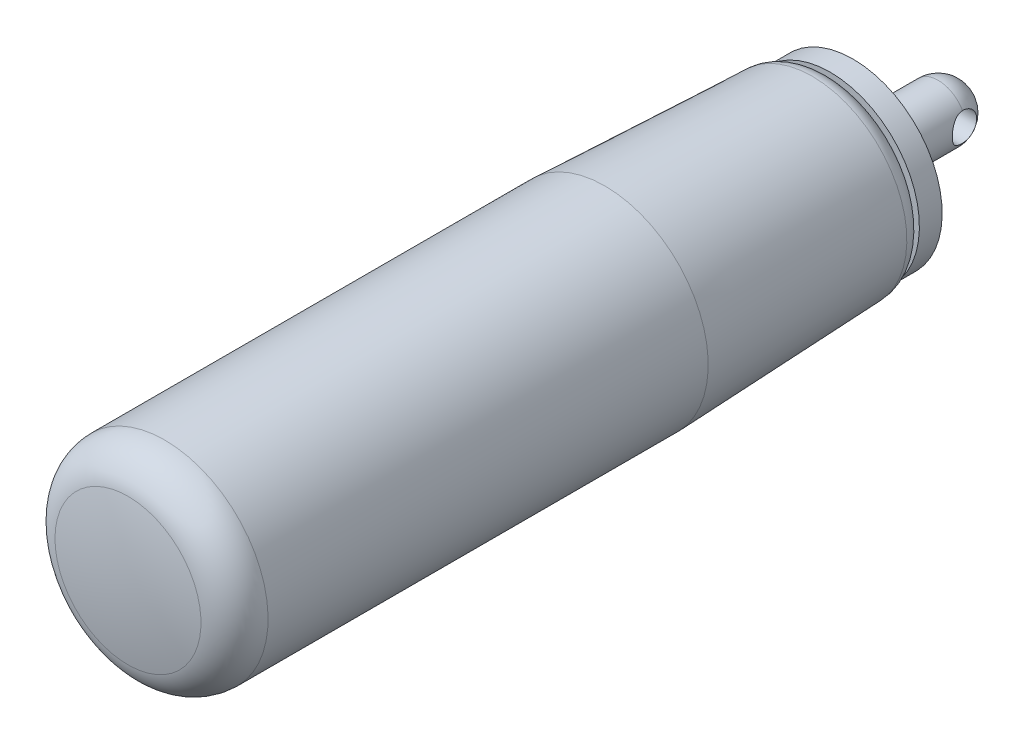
ISO-10303-21;
HEADER;
FILE_DESCRIPTION(('STEP AP214'),'2;1');
FILE_NAME('part.step','',(''),(''),'','','');
FILE_SCHEMA(('AUTOMOTIVE_DESIGN { 1 0 10303 214 1 1 1 1 }'));
ENDSEC;
DATA;
#1=APPLICATION_CONTEXT('core data for automotive mechanical design processes');
#2=APPLICATION_PROTOCOL_DEFINITION('international standard','automotive_design',2000,#1);
#3=PRODUCT_CONTEXT('',#1,'mechanical');
#4=PRODUCT('Part','Part','',(#3));
#5=PRODUCT_RELATED_PRODUCT_CATEGORY('part','',(#4));
#6=PRODUCT_DEFINITION_FORMATION('','',#4);
#7=PRODUCT_DEFINITION_CONTEXT('part definition',#1,'design');
#8=PRODUCT_DEFINITION('design','',#6,#7);
#9=PRODUCT_DEFINITION_SHAPE('','',#8);
#10=(LENGTH_UNIT() NAMED_UNIT(*) SI_UNIT(.MILLI.,.METRE.));
#11=(NAMED_UNIT(*) PLANE_ANGLE_UNIT() SI_UNIT($,.RADIAN.));
#12=(NAMED_UNIT(*) SI_UNIT($,.STERADIAN.) SOLID_ANGLE_UNIT());
#13=UNCERTAINTY_MEASURE_WITH_UNIT(LENGTH_MEASURE(1.E-05),#10,'distance_accuracy_value','');
#14=(GEOMETRIC_REPRESENTATION_CONTEXT(3) GLOBAL_UNCERTAINTY_ASSIGNED_CONTEXT((#13)) GLOBAL_UNIT_ASSIGNED_CONTEXT((#10,
#11,#12)) REPRESENTATION_CONTEXT('',''));
#15=CARTESIAN_POINT('',(0.,0.,0.));
#16=DIRECTION('',(0.,0.,1.));
#17=DIRECTION('',(1.,0.,0.));
#18=AXIS2_PLACEMENT_3D('',#15,#16,#17);
#19=CARTESIAN_POINT('',(0.,0.,0.));
#20=DIRECTION('',(0.,1.,0.));
#21=DIRECTION('',(1.,0.,0.));
#22=AXIS2_PLACEMENT_3D('',#19,#20,#21);
#23=SPHERICAL_SURFACE('',#22,3.);
#24=CARTESIAN_POINT('',(2.59807621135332,0.,0.));
#25=DIRECTION('',(-1.,0.,0.));
#26=DIRECTION('',(0.,1.,0.));
#27=AXIS2_PLACEMENT_3D('',#24,#25,#26);
#28=CIRCLE('',#27,1.5);
#29=CARTESIAN_POINT('',(2.59807621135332,-1.5,0.));
#30=VERTEX_POINT('',#29);
#31=CARTESIAN_POINT('',(2.59807621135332,1.5,0.));
#32=VERTEX_POINT('',#31);
#33=EDGE_CURVE('E37',#30,#32,#28,.F.);
#34=ORIENTED_EDGE('',*,*,#33,.F.);
#35=CARTESIAN_POINT('',(0.,0.,0.));
#36=DIRECTION('',(0.,0.,-1.));
#37=DIRECTION('',(0.,1.,0.));
#38=AXIS2_PLACEMENT_3D('',#35,#36,#37);
#39=CIRCLE('',#38,3.);
#40=CARTESIAN_POINT('',(-2.59807621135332,-1.5,0.));
#41=VERTEX_POINT('',#40);
#42=EDGE_CURVE('E47',#30,#41,#39,.T.);
#43=ORIENTED_EDGE('',*,*,#42,.T.);
#44=CARTESIAN_POINT('',(-2.59807621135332,0.,0.));
#45=DIRECTION('',(1.,0.,0.));
#46=DIRECTION('',(0.,-1.,0.));
#47=AXIS2_PLACEMENT_3D('',#44,#45,#46);
#48=CIRCLE('',#47,1.5);
#49=CARTESIAN_POINT('',(-2.59807621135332,1.5,0.));
#50=VERTEX_POINT('',#49);
#51=EDGE_CURVE('E30',#50,#41,#48,.F.);
#52=ORIENTED_EDGE('',*,*,#51,.F.);
#53=EDGE_CURVE('E50',#50,#32,#39,.T.);
#54=ORIENTED_EDGE('',*,*,#53,.T.);
#55=EDGE_LOOP('',(#34,#43,#52,#54));
#56=FACE_BOUND('',#55,.T.);
#57=ADVANCED_FACE('F14',(#56),#23,.T.);
#58=CARTESIAN_POINT('',(0.,0.,-20.));
#59=DIRECTION('',(0.,0.,-1.));
#60=DIRECTION('',(0.,1.,0.));
#61=AXIS2_PLACEMENT_3D('',#58,#59,#60);
#62=CYLINDRICAL_SURFACE('',#61,3.);
#63=CARTESIAN_POINT('',(-2.59807621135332,-1.5,0.));
#64=CARTESIAN_POINT('',(-2.59808302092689,-1.4999945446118,0.0781617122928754));
#65=CARTESIAN_POINT('',(-2.60165701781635,-1.49384995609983,0.156422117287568));
#66=CARTESIAN_POINT('',(-2.61543549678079,-1.46958481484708,0.31054089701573));
#67=CARTESIAN_POINT('',(-2.62565391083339,-1.45143909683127,0.386393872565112));
#68=CARTESIAN_POINT('',(-2.65124019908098,-1.40414992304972,0.533177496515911));
#69=CARTESIAN_POINT('',(-2.66658065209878,-1.3750649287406,0.604131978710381));
#70=CARTESIAN_POINT('',(-2.70063997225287,-1.30690128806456,0.74013630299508));
#71=CARTESIAN_POINT('',(-2.71935902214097,-1.26782210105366,0.805185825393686));
#72=CARTESIAN_POINT('',(-2.75995303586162,-1.17699981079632,0.933458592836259));
#73=CARTESIAN_POINT('',(-2.7819609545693,-1.12447805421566,0.996088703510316));
#74=CARTESIAN_POINT('',(-2.82557974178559,-1.0098807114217,1.11211258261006));
#75=CARTESIAN_POINT('',(-2.84719040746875,-0.94780038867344,1.16550174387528));
#76=CARTESIAN_POINT('',(-2.88932215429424,-0.81073434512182,1.26505072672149));
#77=CARTESIAN_POINT('',(-2.90967159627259,-0.735160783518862,1.3104806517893));
#78=CARTESIAN_POINT('',(-2.94526134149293,-0.576235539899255,1.38771127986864));
#79=CARTESIAN_POINT('',(-2.96050486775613,-0.492888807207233,1.41952058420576));
#80=CARTESIAN_POINT('',(-2.98320691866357,-0.327067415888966,1.46625699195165));
#81=CARTESIAN_POINT('',(-2.99114220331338,-0.244952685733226,1.4822242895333));
#82=CARTESIAN_POINT('',(-3.000113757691,-0.0788559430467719,1.50024917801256));
#83=CARTESIAN_POINT('',(-3.00115420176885,0.0051249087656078,1.50231518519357));
#84=CARTESIAN_POINT('',(-2.99644472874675,0.164748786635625,1.49287998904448));
#85=CARTESIAN_POINT('',(-2.99127743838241,0.240481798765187,1.48254297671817));
#86=CARTESIAN_POINT('',(-2.97561367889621,0.388970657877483,1.45067873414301));
#87=CARTESIAN_POINT('',(-2.96511681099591,0.461726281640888,1.42915066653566));
#88=CARTESIAN_POINT('',(-2.93957374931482,0.60346408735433,1.37537615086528));
#89=CARTESIAN_POINT('',(-2.92446662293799,0.672380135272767,1.3429855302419));
#90=CARTESIAN_POINT('',(-2.89106468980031,0.803965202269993,1.26860487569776));
#91=CARTESIAN_POINT('',(-2.87276874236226,0.866631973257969,1.22661140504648));
#92=CARTESIAN_POINT('',(-2.83266591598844,0.990260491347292,1.12965697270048));
#93=CARTESIAN_POINT('',(-2.81069063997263,1.05050111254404,1.07384545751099));
#94=CARTESIAN_POINT('',(-2.76681510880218,1.16115655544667,0.953115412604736));
#95=CARTESIAN_POINT('',(-2.74491492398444,1.21156381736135,0.888189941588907));
#96=CARTESIAN_POINT('',(-2.70216234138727,1.30425800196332,0.746027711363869));
#97=CARTESIAN_POINT('',(-2.68146479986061,1.34582597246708,0.668270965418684));
#98=CARTESIAN_POINT('',(-2.64563175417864,1.41497866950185,0.505593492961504));
#99=CARTESIAN_POINT('',(-2.63049045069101,1.44257798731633,0.420680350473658));
#100=CARTESIAN_POINT('',(-2.60916953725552,1.48077031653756,0.253178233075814));
#101=CARTESIAN_POINT('',(-2.60237483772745,1.49253768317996,0.170938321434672));
#102=CARTESIAN_POINT('',(-2.59676879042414,1.50227541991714,0.00539798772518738));
#103=CARTESIAN_POINT('',(-2.59795180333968,1.50025553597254,-0.0779016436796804));
#104=CARTESIAN_POINT('',(-2.60751504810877,1.48355406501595,-0.233480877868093));
#105=CARTESIAN_POINT('',(-2.61509381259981,1.4702817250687,-0.305969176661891));
#106=CARTESIAN_POINT('',(-2.63541032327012,1.43354442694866,-0.447551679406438));
#107=CARTESIAN_POINT('',(-2.64814974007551,1.41007616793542,-0.516644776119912));
#108=CARTESIAN_POINT('',(-2.67804333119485,1.35247138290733,-0.653116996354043));
#109=CARTESIAN_POINT('',(-2.69537464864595,1.31789109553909,-0.720268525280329));
#110=CARTESIAN_POINT('',(-2.73234179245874,1.23943059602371,-0.848203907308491));
#111=CARTESIAN_POINT('',(-2.75197880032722,1.19554560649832,-0.908984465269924));
#112=CARTESIAN_POINT('',(-2.79431997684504,1.09325575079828,-1.03046815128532));
#113=CARTESIAN_POINT('',(-2.81709874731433,1.03371790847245,-1.09019572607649));
#114=CARTESIAN_POINT('',(-2.86101352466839,0.905106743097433,-1.19911835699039));
#115=CARTESIAN_POINT('',(-2.88214897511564,0.836030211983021,-1.24830985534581));
#116=CARTESIAN_POINT('',(-2.92112042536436,0.687803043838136,-1.33586058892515));
#117=CARTESIAN_POINT('',(-2.93885462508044,0.608434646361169,-1.37389967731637));
#118=CARTESIAN_POINT('',(-2.96825032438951,0.443283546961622,-1.43570685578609));
#119=CARTESIAN_POINT('',(-2.9799171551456,0.357506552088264,-1.45948747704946));
#120=CARTESIAN_POINT('',(-2.99501262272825,0.190469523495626,-1.49005284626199));
#121=CARTESIAN_POINT('',(-2.99909891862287,0.109517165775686,-1.49819681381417));
#122=CARTESIAN_POINT('',(-3.00063195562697,-0.0526889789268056,-1.5012648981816));
#123=CARTESIAN_POINT('',(-2.99808102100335,-0.13394265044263,-1.49619364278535));
#124=CARTESIAN_POINT('',(-2.98700953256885,-0.288806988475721,-1.47387538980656));
#125=CARTESIAN_POINT('',(-2.97889342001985,-0.362568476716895,-1.45745272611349));
#126=CARTESIAN_POINT('',(-2.95788140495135,-0.506168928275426,-1.41400950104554));
#127=CARTESIAN_POINT('',(-2.94498481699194,-0.576007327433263,-1.38698741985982));
#128=CARTESIAN_POINT('',(-2.91488896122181,-0.713135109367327,-1.32190942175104));
#129=CARTESIAN_POINT('',(-2.89752925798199,-0.780187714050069,-1.28343101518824));
#130=CARTESIAN_POINT('',(-2.86032199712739,-0.907161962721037,-1.19706310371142));
#131=CARTESIAN_POINT('',(-2.84047329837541,-0.967080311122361,-1.14916927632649));
#132=CARTESIAN_POINT('',(-2.79792915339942,-1.08437100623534,-1.03980429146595));
#133=CARTESIAN_POINT('',(-2.77514698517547,-1.14089652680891,-0.977456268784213));
#134=CARTESIAN_POINT('',(-2.73094614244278,-1.24299493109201,-0.843823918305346));
#135=CARTESIAN_POINT('',(-2.70952868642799,-1.28855812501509,-0.772531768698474));
#136=CARTESIAN_POINT('',(-2.66999407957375,-1.36864661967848,-0.620045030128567));
#137=CARTESIAN_POINT('',(-2.65200261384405,-1.40277759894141,-0.538608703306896));
#138=CARTESIAN_POINT('',(-2.62299234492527,-1.45631806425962,-0.370001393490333));
#139=CARTESIAN_POINT('',(-2.61195024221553,-1.47577678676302,-0.28285066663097));
#140=CARTESIAN_POINT('',(-2.60293908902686,-1.49155051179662,-0.162291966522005));
#141=CARTESIAN_POINT('',(-2.60112193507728,-1.49471415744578,-0.129948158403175));
#142=CARTESIAN_POINT('',(-2.59868903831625,-1.49894010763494,-0.0650752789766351));
#143=CARTESIAN_POINT('',(-2.59807337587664,-1.50000227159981,-0.0325461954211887));
#144=CARTESIAN_POINT('',(-2.59807621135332,-1.5,0.));
#145=B_SPLINE_CURVE_WITH_KNOTS('',3,(#63,#64,#65,#66,#67,#68,#69,#70,#71,#72,#73,#74,#75,#76,
#77,#78,#79,#80,#81,#82,#83,#84,#85,#86,#87,#88,#89,#90,#91,#92,#93,#94,#95,#96,#97,#98,#99,
#100,#101,#102,#103,#104,#105,#106,#107,#108,#109,#110,#111,#112,#113,#114,#115,#116,#117,#118,
#119,#120,#121,#122,#123,#124,#125,#126,#127,#128,#129,#130,#131,#132,#133,#134,#135,#136,#137,
#138,#139,#140,#141,#142,#143,#144),.UNSPECIFIED.,.T.,.F.,(4,2,2,2,2,2,2,2,2,2,2,2,2,2,2,2,2,2,
2,2,2,2,2,2,2,2,2,2,2,2,2,2,2,2,2,2,2,2,2,2,4),(0.,0.234348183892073,0.469189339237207,
0.702792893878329,0.936409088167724,1.18929346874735,1.44230356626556,1.71236838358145,
1.98226240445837,2.23295227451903,2.4834903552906,2.71224146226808,2.94100968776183,
3.1729430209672,3.40495949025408,3.65890787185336,3.91305072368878,4.18333262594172,
4.45333161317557,4.70193436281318,4.95036139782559,5.17161275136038,5.39293578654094,
5.62450944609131,5.85620229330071,6.1171011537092,6.37808797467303,6.64596272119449,
6.91360169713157,7.1566840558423,7.39968130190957,7.62666637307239,7.85368400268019,
8.09041126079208,8.32724745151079,8.58765362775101,8.84828914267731,9.11716123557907,
9.3851269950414,9.48270202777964,9.58028358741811),.UNSPECIFIED.);
#146=EDGE_CURVE('E9',#41,#50,#145,.T.);
#147=ORIENTED_EDGE('',*,*,#146,.F.);
#148=ORIENTED_EDGE('',*,*,#42,.F.);
#149=CARTESIAN_POINT('',(2.59807621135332,-1.5,0.));
#150=CARTESIAN_POINT('',(2.59808302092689,-1.4999945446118,-0.0781617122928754));
#151=CARTESIAN_POINT('',(2.60165701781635,-1.49384995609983,-0.156422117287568));
#152=CARTESIAN_POINT('',(2.61543549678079,-1.46958481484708,-0.31054089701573));
#153=CARTESIAN_POINT('',(2.62565391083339,-1.45143909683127,-0.386393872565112));
#154=CARTESIAN_POINT('',(2.65124019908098,-1.40414992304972,-0.533177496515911));
#155=CARTESIAN_POINT('',(2.66658065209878,-1.3750649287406,-0.604131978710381));
#156=CARTESIAN_POINT('',(2.70063997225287,-1.30690128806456,-0.74013630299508));
#157=CARTESIAN_POINT('',(2.71935902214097,-1.26782210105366,-0.805185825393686));
#158=CARTESIAN_POINT('',(2.75995303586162,-1.17699981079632,-0.933458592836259));
#159=CARTESIAN_POINT('',(2.7819609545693,-1.12447805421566,-0.996088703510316));
#160=CARTESIAN_POINT('',(2.82557974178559,-1.0098807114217,-1.11211258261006));
#161=CARTESIAN_POINT('',(2.84719040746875,-0.94780038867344,-1.16550174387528));
#162=CARTESIAN_POINT('',(2.88932215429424,-0.81073434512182,-1.26505072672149));
#163=CARTESIAN_POINT('',(2.90967159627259,-0.735160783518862,-1.3104806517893));
#164=CARTESIAN_POINT('',(2.94526134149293,-0.576235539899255,-1.38771127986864));
#165=CARTESIAN_POINT('',(2.96050486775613,-0.492888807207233,-1.41952058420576));
#166=CARTESIAN_POINT('',(2.98320691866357,-0.327067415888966,-1.46625699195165));
#167=CARTESIAN_POINT('',(2.99114220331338,-0.244952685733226,-1.4822242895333));
#168=CARTESIAN_POINT('',(3.000113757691,-0.0788559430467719,-1.50024917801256));
#169=CARTESIAN_POINT('',(3.00115420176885,0.0051249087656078,-1.50231518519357));
#170=CARTESIAN_POINT('',(2.99644472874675,0.164748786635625,-1.49287998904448));
#171=CARTESIAN_POINT('',(2.99127743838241,0.240481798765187,-1.48254297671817));
#172=CARTESIAN_POINT('',(2.97561367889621,0.388970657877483,-1.45067873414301));
#173=CARTESIAN_POINT('',(2.96511681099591,0.461726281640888,-1.42915066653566));
#174=CARTESIAN_POINT('',(2.93957374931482,0.60346408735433,-1.37537615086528));
#175=CARTESIAN_POINT('',(2.92446662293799,0.672380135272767,-1.3429855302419));
#176=CARTESIAN_POINT('',(2.89106468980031,0.803965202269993,-1.26860487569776));
#177=CARTESIAN_POINT('',(2.87276874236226,0.866631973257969,-1.22661140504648));
#178=CARTESIAN_POINT('',(2.83266591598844,0.990260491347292,-1.12965697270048));
#179=CARTESIAN_POINT('',(2.81069063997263,1.05050111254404,-1.07384545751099));
#180=CARTESIAN_POINT('',(2.76681510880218,1.16115655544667,-0.953115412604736));
#181=CARTESIAN_POINT('',(2.74491492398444,1.21156381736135,-0.888189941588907));
#182=CARTESIAN_POINT('',(2.70216234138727,1.30425800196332,-0.746027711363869));
#183=CARTESIAN_POINT('',(2.68146479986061,1.34582597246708,-0.668270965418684));
#184=CARTESIAN_POINT('',(2.64563175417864,1.41497866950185,-0.505593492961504));
#185=CARTESIAN_POINT('',(2.63049045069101,1.44257798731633,-0.420680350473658));
#186=CARTESIAN_POINT('',(2.60916953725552,1.48077031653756,-0.253178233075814));
#187=CARTESIAN_POINT('',(2.60237483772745,1.49253768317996,-0.170938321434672));
#188=CARTESIAN_POINT('',(2.59676879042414,1.50227541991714,-0.00539798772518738));
#189=CARTESIAN_POINT('',(2.59795180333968,1.50025553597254,0.0779016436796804));
#190=CARTESIAN_POINT('',(2.60751504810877,1.48355406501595,0.233480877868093));
#191=CARTESIAN_POINT('',(2.61509381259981,1.4702817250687,0.305969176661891));
#192=CARTESIAN_POINT('',(2.63541032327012,1.43354442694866,0.447551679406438));
#193=CARTESIAN_POINT('',(2.64814974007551,1.41007616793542,0.516644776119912));
#194=CARTESIAN_POINT('',(2.67804333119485,1.35247138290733,0.653116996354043));
#195=CARTESIAN_POINT('',(2.69537464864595,1.31789109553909,0.720268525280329));
#196=CARTESIAN_POINT('',(2.73234179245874,1.23943059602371,0.848203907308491));
#197=CARTESIAN_POINT('',(2.75197880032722,1.19554560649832,0.908984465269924));
#198=CARTESIAN_POINT('',(2.79431997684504,1.09325575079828,1.03046815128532));
#199=CARTESIAN_POINT('',(2.81709874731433,1.03371790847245,1.09019572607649));
#200=CARTESIAN_POINT('',(2.86101352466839,0.905106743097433,1.19911835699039));
#201=CARTESIAN_POINT('',(2.88214897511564,0.836030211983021,1.24830985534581));
#202=CARTESIAN_POINT('',(2.92112042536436,0.687803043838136,1.33586058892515));
#203=CARTESIAN_POINT('',(2.93885462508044,0.608434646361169,1.37389967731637));
#204=CARTESIAN_POINT('',(2.96825032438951,0.443283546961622,1.43570685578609));
#205=CARTESIAN_POINT('',(2.9799171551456,0.357506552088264,1.45948747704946));
#206=CARTESIAN_POINT('',(2.99501262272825,0.190469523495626,1.49005284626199));
#207=CARTESIAN_POINT('',(2.99909891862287,0.109517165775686,1.49819681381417));
#208=CARTESIAN_POINT('',(3.00063195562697,-0.0526889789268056,1.5012648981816));
#209=CARTESIAN_POINT('',(2.99808102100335,-0.13394265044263,1.49619364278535));
#210=CARTESIAN_POINT('',(2.98700953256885,-0.288806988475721,1.47387538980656));
#211=CARTESIAN_POINT('',(2.97889342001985,-0.362568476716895,1.45745272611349));
#212=CARTESIAN_POINT('',(2.95788140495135,-0.506168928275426,1.41400950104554));
#213=CARTESIAN_POINT('',(2.94498481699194,-0.576007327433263,1.38698741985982));
#214=CARTESIAN_POINT('',(2.91488896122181,-0.713135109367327,1.32190942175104));
#215=CARTESIAN_POINT('',(2.89752925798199,-0.780187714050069,1.28343101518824));
#216=CARTESIAN_POINT('',(2.86032199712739,-0.907161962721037,1.19706310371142));
#217=CARTESIAN_POINT('',(2.84047329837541,-0.967080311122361,1.14916927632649));
#218=CARTESIAN_POINT('',(2.79792915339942,-1.08437100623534,1.03980429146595));
#219=CARTESIAN_POINT('',(2.77514698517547,-1.14089652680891,0.977456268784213));
#220=CARTESIAN_POINT('',(2.73094614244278,-1.24299493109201,0.843823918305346));
#221=CARTESIAN_POINT('',(2.70952868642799,-1.28855812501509,0.772531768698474));
#222=CARTESIAN_POINT('',(2.66999407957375,-1.36864661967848,0.620045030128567));
#223=CARTESIAN_POINT('',(2.65200261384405,-1.40277759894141,0.538608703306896));
#224=CARTESIAN_POINT('',(2.62299234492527,-1.45631806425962,0.370001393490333));
#225=CARTESIAN_POINT('',(2.61195024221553,-1.47577678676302,0.28285066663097));
#226=CARTESIAN_POINT('',(2.60293908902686,-1.49155051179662,0.162291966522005));
#227=CARTESIAN_POINT('',(2.60112193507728,-1.49471415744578,0.129948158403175));
#228=CARTESIAN_POINT('',(2.59868903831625,-1.49894010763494,0.0650752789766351));
#229=CARTESIAN_POINT('',(2.59807337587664,-1.50000227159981,0.0325461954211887));
#230=CARTESIAN_POINT('',(2.59807621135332,-1.5,0.));
#231=B_SPLINE_CURVE_WITH_KNOTS('',3,(#149,#150,#151,#152,#153,#154,#155,#156,#157,#158,#159,
#160,#161,#162,#163,#164,#165,#166,#167,#168,#169,#170,#171,#172,#173,#174,#175,#176,#177,#178,
#179,#180,#181,#182,#183,#184,#185,#186,#187,#188,#189,#190,#191,#192,#193,#194,#195,#196,#197,
#198,#199,#200,#201,#202,#203,#204,#205,#206,#207,#208,#209,#210,#211,#212,#213,#214,#215,#216,
#217,#218,#219,#220,#221,#222,#223,#224,#225,#226,#227,#228,#229,#230),.UNSPECIFIED.,.T.,.F.,(4,
2,2,2,2,2,2,2,2,2,2,2,2,2,2,2,2,2,2,2,2,2,2,2,2,2,2,2,2,2,2,2,2,2,2,2,2,2,2,2,4),(0.,
0.234348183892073,0.469189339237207,0.702792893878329,0.936409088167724,1.18929346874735,
1.44230356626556,1.71236838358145,1.98226240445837,2.23295227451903,2.4834903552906,
2.71224146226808,2.94100968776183,3.1729430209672,3.40495949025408,3.65890787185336,
3.91305072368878,4.18333262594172,4.45333161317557,4.70193436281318,4.95036139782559,
5.17161275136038,5.39293578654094,5.62450944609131,5.85620229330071,6.1171011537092,
6.37808797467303,6.64596272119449,6.91360169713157,7.1566840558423,7.39968130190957,
7.62666637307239,7.85368400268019,8.09041126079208,8.32724745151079,8.58765362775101,
8.84828914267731,9.11716123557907,9.3851269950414,9.48270202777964,9.58028358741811),.UNSPECIFIED.);
#232=EDGE_CURVE('E25',#32,#30,#231,.T.);
#233=ORIENTED_EDGE('',*,*,#232,.F.);
#234=ORIENTED_EDGE('',*,*,#53,.F.);
#235=EDGE_LOOP('',(#147,#148,#233,#234));
#236=FACE_BOUND('',#235,.T.);
#237=CARTESIAN_POINT('',(0.,0.,9.07503370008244));
#238=DIRECTION('',(0.,0.,-1.));
#239=DIRECTION('',(0.,1.,0.));
#240=AXIS2_PLACEMENT_3D('',#237,#238,#239);
#241=CIRCLE('',#240,3.);
#242=CARTESIAN_POINT('',(0.,3.,9.07503370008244));
#243=VERTEX_POINT('',#242);
#244=EDGE_CURVE('E56',#243,#243,#241,.T.);
#245=ORIENTED_EDGE('',*,*,#244,.T.);
#246=EDGE_LOOP('',(#245));
#247=FACE_BOUND('',#246,.T.);
#248=ADVANCED_FACE('F53',(#236,#247),#62,.T.);
#249=CARTESIAN_POINT('',(-9.49999999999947,0.,9.07503370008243));
#250=DIRECTION('',(0.,0.,1.));
#251=DIRECTION('',(0.,-1.,0.));
#252=AXIS2_PLACEMENT_3D('',#249,#250,#251);
#253=PLANE('',#252);
#254=ORIENTED_EDGE('',*,*,#244,.F.);
#255=EDGE_LOOP('',(#254));
#256=FACE_BOUND('',#255,.T.);
#257=CARTESIAN_POINT('',(0.,0.,9.07503370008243));
#258=DIRECTION('',(0.,0.,-1.));
#259=DIRECTION('',(0.,1.,0.));
#260=AXIS2_PLACEMENT_3D('',#257,#258,#259);
#261=CIRCLE('',#260,9.49999999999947);
#262=CARTESIAN_POINT('',(0.,9.49999999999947,9.07503370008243));
#263=VERTEX_POINT('',#262);
#264=EDGE_CURVE('E194',#263,#263,#261,.T.);
#265=ORIENTED_EDGE('',*,*,#264,.T.);
#266=EDGE_LOOP('',(#265));
#267=FACE_BOUND('',#266,.T.);
#268=ADVANCED_FACE('F89',(#256,#267),#253,.F.);
#269=CARTESIAN_POINT('',(0.,0.,-20.));
#270=DIRECTION('',(0.,0.,-1.));
#271=DIRECTION('',(0.,1.,0.));
#272=AXIS2_PLACEMENT_3D('',#269,#270,#271);
#273=CYLINDRICAL_SURFACE('',#272,9.49999999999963);
#274=ORIENTED_EDGE('',*,*,#264,.F.);
#275=EDGE_LOOP('',(#274));
#276=FACE_BOUND('',#275,.T.);
#277=CARTESIAN_POINT('',(0.,0.,11.5));
#278=DIRECTION('',(0.,0.,-1.));
#279=DIRECTION('',(0.,1.,0.));
#280=AXIS2_PLACEMENT_3D('',#277,#278,#279);
#281=CIRCLE('',#280,9.49999999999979);
#282=CARTESIAN_POINT('',(0.,9.49999999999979,11.5));
#283=VERTEX_POINT('',#282);
#284=EDGE_CURVE('E192',#283,#283,#281,.T.);
#285=ORIENTED_EDGE('',*,*,#284,.T.);
#286=EDGE_LOOP('',(#285));
#287=FACE_BOUND('',#286,.T.);
#288=ADVANCED_FACE('F86',(#276,#287),#273,.T.);
#289=CARTESIAN_POINT('',(-8.08159797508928,0.,11.5));
#290=DIRECTION('',(0.,0.,-1.));
#291=DIRECTION('',(0.,1.,0.));
#292=AXIS2_PLACEMENT_3D('',#289,#290,#291);
#293=PLANE('',#292);
#294=ORIENTED_EDGE('',*,*,#284,.F.);
#295=EDGE_LOOP('',(#294));
#296=FACE_BOUND('',#295,.T.);
#297=CARTESIAN_POINT('',(0.,0.,11.5));
#298=DIRECTION('',(0.,0.,-1.));
#299=DIRECTION('',(0.,1.,0.));
#300=AXIS2_PLACEMENT_3D('',#297,#298,#299);
#301=CIRCLE('',#300,8.08159797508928);
#302=CARTESIAN_POINT('',(0.,8.08159797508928,11.5));
#303=VERTEX_POINT('',#302);
#304=EDGE_CURVE('E189',#303,#303,#301,.T.);
#305=ORIENTED_EDGE('',*,*,#304,.T.);
#306=EDGE_LOOP('',(#305));
#307=FACE_BOUND('',#306,.T.);
#308=ADVANCED_FACE('F82',(#296,#307),#293,.F.);
#309=CARTESIAN_POINT('',(0.,0.,13.5));
#310=DIRECTION('',(0.,0.,-1.));
#311=DIRECTION('',(0.,1.,0.));
#312=AXIS2_PLACEMENT_3D('',#309,#310,#311);
#313=TOROIDAL_SURFACE('',#312,8.08159797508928,1.99999999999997);
#314=CARTESIAN_POINT('',(0.,0.,13.4167389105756));
#315=DIRECTION('',(0.,0.,-1.));
#316=DIRECTION('',(0.,1.,0.));
#317=AXIS2_PLACEMENT_3D('',#314,#315,#316);
#318=CIRCLE('',#317,10.079864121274);
#319=CARTESIAN_POINT('',(0.,10.079864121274,13.4167389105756));
#320=VERTEX_POINT('',#319);
#321=EDGE_CURVE('E186',#320,#320,#318,.T.);
#322=ORIENTED_EDGE('',*,*,#321,.T.);
#323=EDGE_LOOP('',(#322));
#324=FACE_BOUND('',#323,.T.);
#325=ORIENTED_EDGE('',*,*,#304,.F.);
#326=EDGE_LOOP('',(#325));
#327=FACE_BOUND('',#326,.T.);
#328=ADVANCED_FACE('F78',(#324,#327),#313,.T.);
#329=CARTESIAN_POINT('',(0.,0.,35.4999999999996));
#330=DIRECTION('',(0.,0.,1.));
#331=DIRECTION('',(0.,-1.,0.));
#332=AXIS2_PLACEMENT_3D('',#329,#330,#331);
#333=CONICAL_SURFACE('',#332,11.,0.0416425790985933);
#334=ORIENTED_EDGE('',*,*,#321,.F.);
#335=EDGE_LOOP('',(#334));
#336=FACE_BOUND('',#335,.T.);
#337=CARTESIAN_POINT('',(0.,0.,35.4999999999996));
#338=DIRECTION('',(0.,0.,-1.));
#339=DIRECTION('',(0.,1.,0.));
#340=AXIS2_PLACEMENT_3D('',#337,#338,#339);
#341=CIRCLE('',#340,11.);
#342=CARTESIAN_POINT('',(0.,11.,35.4999999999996));
#343=VERTEX_POINT('',#342);
#344=EDGE_CURVE('E183',#343,#343,#341,.T.);
#345=ORIENTED_EDGE('',*,*,#344,.T.);
#346=EDGE_LOOP('',(#345));
#347=FACE_BOUND('',#346,.T.);
#348=ADVANCED_FACE('F74',(#336,#347),#333,.T.);
#349=CARTESIAN_POINT('',(0.,0.,-20.));
#350=DIRECTION('',(0.,0.,-1.));
#351=DIRECTION('',(0.,1.,0.));
#352=AXIS2_PLACEMENT_3D('',#349,#350,#351);
#353=CYLINDRICAL_SURFACE('',#352,11.);
#354=ORIENTED_EDGE('',*,*,#344,.F.);
#355=EDGE_LOOP('',(#354));
#356=FACE_BOUND('',#355,.T.);
#357=CARTESIAN_POINT('',(0.,0.,82.3879208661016));
#358=DIRECTION('',(0.,0.,-1.));
#359=DIRECTION('',(-1.,0.,0.));
#360=AXIS2_PLACEMENT_3D('',#357,#358,#359);
#361=CIRCLE('',#360,11.);
#362=CARTESIAN_POINT('',(-11.,0.,82.3879208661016));
#363=VERTEX_POINT('',#362);
#364=EDGE_CURVE('E51',#363,#363,#361,.T.);
#365=ORIENTED_EDGE('',*,*,#364,.T.);
#366=EDGE_LOOP('',(#365));
#367=FACE_BOUND('',#366,.T.);
#368=ADVANCED_FACE('F69',(#356,#367),#353,.T.);
#369=CARTESIAN_POINT('',(-5.,0.,0.));
#370=DIRECTION('',(1.,0.,0.));
#371=DIRECTION('',(0.,-1.,0.));
#372=AXIS2_PLACEMENT_3D('',#369,#370,#371);
#373=CYLINDRICAL_SURFACE('',#372,1.5);
#374=ORIENTED_EDGE('',*,*,#51,.T.);
#375=ORIENTED_EDGE('',*,*,#146,.T.);
#376=EDGE_LOOP('',(#374,#375));
#377=FACE_BOUND('',#376,.T.);
#378=ORIENTED_EDGE('',*,*,#33,.T.);
#379=ORIENTED_EDGE('',*,*,#232,.T.);
#380=EDGE_LOOP('',(#378,#379));
#381=FACE_BOUND('',#380,.T.);
#382=ADVANCED_FACE('F42',(#377,#381),#373,.F.);
#383=CARTESIAN_POINT('',(0.,0.,82.3879208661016));
#384=DIRECTION('',(0.,0.,-1.));
#385=DIRECTION('',(-1.,0.,0.));
#386=AXIS2_PLACEMENT_3D('',#383,#384,#385);
#387=TOROIDAL_SURFACE('',#386,7.,4.);
#388=CARTESIAN_POINT('',(0.,0.,86.3115749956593));
#389=DIRECTION('',(0.,0.,-1.));
#390=DIRECTION('',(-1.,0.,0.));
#391=AXIS2_PLACEMENT_3D('',#388,#389,#390);
#392=CIRCLE('',#391,7.77777777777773);
#393=CARTESIAN_POINT('',(-7.77777777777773,0.,86.3115749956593));
#394=VERTEX_POINT('',#393);
#395=EDGE_CURVE('E177',#394,#394,#392,.T.);
#396=ORIENTED_EDGE('',*,*,#395,.T.);
#397=EDGE_LOOP('',(#396));
#398=FACE_BOUND('',#397,.T.);
#399=ORIENTED_EDGE('',*,*,#364,.F.);
#400=EDGE_LOOP('',(#399));
#401=FACE_BOUND('',#400,.T.);
#402=ADVANCED_FACE('F68',(#398,#401),#387,.T.);
#403=CARTESIAN_POINT('',(0.,0.,47.0750337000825));
#404=DIRECTION('',(0.,0.,-1.));
#405=DIRECTION('',(-1.,0.,0.));
#406=AXIS2_PLACEMENT_3D('',#403,#404,#405);
#407=SPHERICAL_SURFACE('',#406,40.);
#408=ORIENTED_EDGE('',*,*,#395,.F.);
#409=EDGE_LOOP('',(#408));
#410=FACE_BOUND('',#409,.T.);
#411=ADVANCED_FACE('F163',(#410),#407,.T.);
#412=CLOSED_SHELL('',(#57,#248,#268,#288,#308,#328,#348,#368,#382,#402,#411));
#413=MANIFOLD_SOLID_BREP('B1',#412);
#414=ADVANCED_BREP_SHAPE_REPRESENTATION('',(#18,#413),#14);
#415=SHAPE_DEFINITION_REPRESENTATION(#9,#414);
ENDSEC;
END-ISO-10303-21;
